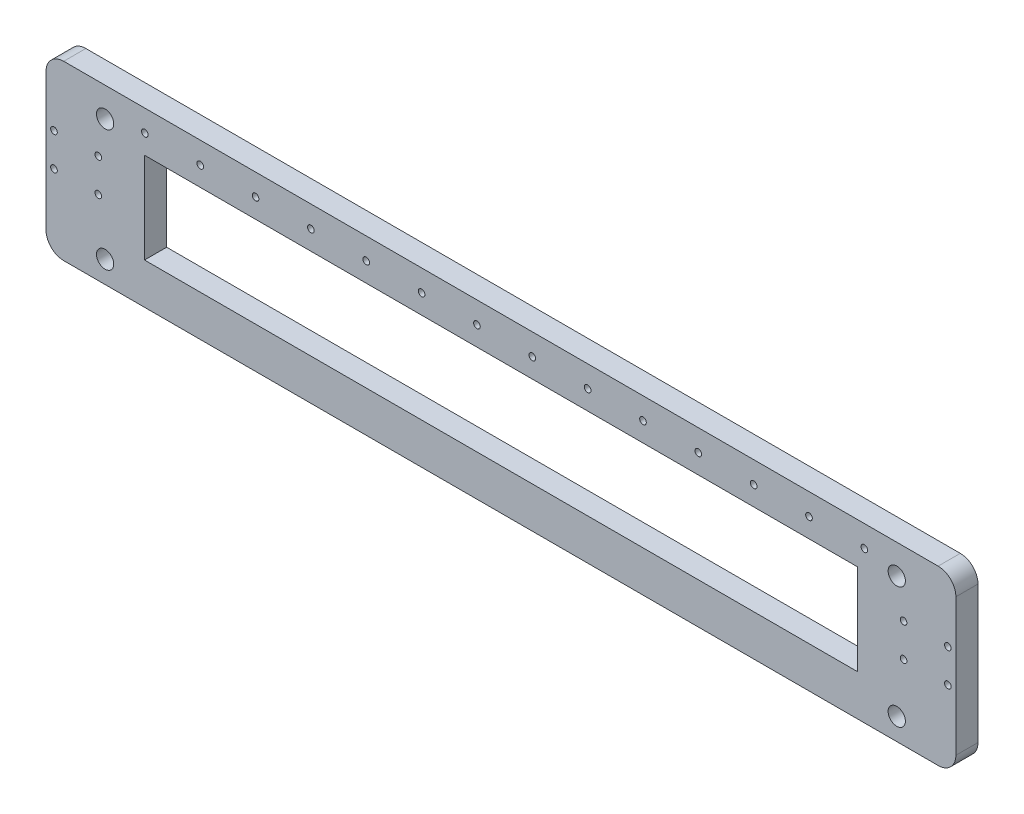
ISO-10303-21;
HEADER;
FILE_DESCRIPTION(('STEP AP214'),'2;1');
FILE_NAME('part.step','',(''),(''),'','','');
FILE_SCHEMA(('AUTOMOTIVE_DESIGN { 1 0 10303 214 1 1 1 1 }'));
ENDSEC;
DATA;
#1=APPLICATION_CONTEXT('core data for automotive mechanical design processes');
#2=APPLICATION_PROTOCOL_DEFINITION('international standard','automotive_design',2000,#1);
#3=PRODUCT_CONTEXT('',#1,'mechanical');
#4=PRODUCT('Part','Part','',(#3));
#5=PRODUCT_RELATED_PRODUCT_CATEGORY('part','',(#4));
#6=PRODUCT_DEFINITION_FORMATION('','',#4);
#7=PRODUCT_DEFINITION_CONTEXT('part definition',#1,'design');
#8=PRODUCT_DEFINITION('design','',#6,#7);
#9=PRODUCT_DEFINITION_SHAPE('','',#8);
#10=(LENGTH_UNIT() NAMED_UNIT(*) SI_UNIT(.MILLI.,.METRE.));
#11=(NAMED_UNIT(*) PLANE_ANGLE_UNIT() SI_UNIT($,.RADIAN.));
#12=(NAMED_UNIT(*) SI_UNIT($,.STERADIAN.) SOLID_ANGLE_UNIT());
#13=UNCERTAINTY_MEASURE_WITH_UNIT(LENGTH_MEASURE(1.E-05),#10,'distance_accuracy_value','');
#14=(GEOMETRIC_REPRESENTATION_CONTEXT(3) GLOBAL_UNCERTAINTY_ASSIGNED_CONTEXT((#13)) GLOBAL_UNIT_ASSIGNED_CONTEXT((#10,
#11,#12)) REPRESENTATION_CONTEXT('',''));
#15=CARTESIAN_POINT('',(0.,0.,0.));
#16=DIRECTION('',(0.,0.,1.));
#17=DIRECTION('',(1.,0.,0.));
#18=AXIS2_PLACEMENT_3D('',#15,#16,#17);
#19=CARTESIAN_POINT('',(197.5,-31.,10.));
#20=DIRECTION('',(0.,0.,1.));
#21=DIRECTION('',(1.,0.,0.));
#22=AXIS2_PLACEMENT_3D('',#19,#20,#21);
#23=PLANE('',#22);
#24=CARTESIAN_POINT('',(-160.835375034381,29.2352985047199,10.));
#25=DIRECTION('',(0.,0.,1.));
#26=DIRECTION('',(1.,0.,0.));
#27=AXIS2_PLACEMENT_3D('',#24,#25,#26);
#28=CIRCLE('',#27,1.5);
#29=CARTESIAN_POINT('',(-159.335375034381,29.2352985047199,10.));
#30=VERTEX_POINT('',#29);
#31=EDGE_CURVE('E310',#30,#30,#28,.T.);
#32=ORIENTED_EDGE('',*,*,#31,.F.);
#33=EDGE_LOOP('',(#32));
#34=FACE_BOUND('',#33,.T.);
#35=CARTESIAN_POINT('',(-135.835375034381,29.2352985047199,10.));
#36=DIRECTION('',(0.,0.,1.));
#37=DIRECTION('',(1.,0.,0.));
#38=AXIS2_PLACEMENT_3D('',#35,#36,#37);
#39=CIRCLE('',#38,1.5);
#40=CARTESIAN_POINT('',(-134.335375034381,29.2352985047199,10.));
#41=VERTEX_POINT('',#40);
#42=EDGE_CURVE('E751',#41,#41,#39,.T.);
#43=ORIENTED_EDGE('',*,*,#42,.F.);
#44=EDGE_LOOP('',(#43));
#45=FACE_BOUND('',#44,.T.);
#46=CARTESIAN_POINT('',(-110.835375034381,29.2352985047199,10.));
#47=DIRECTION('',(0.,0.,1.));
#48=DIRECTION('',(1.,0.,0.));
#49=AXIS2_PLACEMENT_3D('',#46,#47,#48);
#50=CIRCLE('',#49,1.5);
#51=CARTESIAN_POINT('',(-109.335375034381,29.2352985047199,10.));
#52=VERTEX_POINT('',#51);
#53=EDGE_CURVE('E755',#52,#52,#50,.T.);
#54=ORIENTED_EDGE('',*,*,#53,.F.);
#55=EDGE_LOOP('',(#54));
#56=FACE_BOUND('',#55,.T.);
#57=CARTESIAN_POINT('',(-85.8353750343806,29.2352985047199,10.));
#58=DIRECTION('',(0.,0.,1.));
#59=DIRECTION('',(1.,0.,0.));
#60=AXIS2_PLACEMENT_3D('',#57,#58,#59);
#61=CIRCLE('',#60,1.5);
#62=CARTESIAN_POINT('',(-84.3353750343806,29.2352985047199,10.));
#63=VERTEX_POINT('',#62);
#64=EDGE_CURVE('E761',#63,#63,#61,.T.);
#65=ORIENTED_EDGE('',*,*,#64,.F.);
#66=EDGE_LOOP('',(#65));
#67=FACE_BOUND('',#66,.T.);
#68=CARTESIAN_POINT('',(-60.8353750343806,29.2352985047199,10.));
#69=DIRECTION('',(0.,0.,1.));
#70=DIRECTION('',(1.,0.,0.));
#71=AXIS2_PLACEMENT_3D('',#68,#69,#70);
#72=CIRCLE('',#71,1.5);
#73=CARTESIAN_POINT('',(-59.3353750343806,29.2352985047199,10.));
#74=VERTEX_POINT('',#73);
#75=EDGE_CURVE('E765',#74,#74,#72,.T.);
#76=ORIENTED_EDGE('',*,*,#75,.F.);
#77=EDGE_LOOP('',(#76));
#78=FACE_BOUND('',#77,.T.);
#79=CARTESIAN_POINT('',(-35.8353750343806,29.2352985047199,10.));
#80=DIRECTION('',(0.,0.,1.));
#81=DIRECTION('',(1.,0.,0.));
#82=AXIS2_PLACEMENT_3D('',#79,#80,#81);
#83=CIRCLE('',#82,1.5);
#84=CARTESIAN_POINT('',(-34.3353750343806,29.2352985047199,10.));
#85=VERTEX_POINT('',#84);
#86=EDGE_CURVE('E769',#85,#85,#83,.T.);
#87=ORIENTED_EDGE('',*,*,#86,.F.);
#88=EDGE_LOOP('',(#87));
#89=FACE_BOUND('',#88,.T.);
#90=CARTESIAN_POINT('',(-10.8353750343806,29.2352985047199,10.));
#91=DIRECTION('',(0.,0.,1.));
#92=DIRECTION('',(1.,0.,0.));
#93=AXIS2_PLACEMENT_3D('',#90,#91,#92);
#94=CIRCLE('',#93,1.5);
#95=CARTESIAN_POINT('',(-9.33537503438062,29.2352985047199,10.));
#96=VERTEX_POINT('',#95);
#97=EDGE_CURVE('E773',#96,#96,#94,.T.);
#98=ORIENTED_EDGE('',*,*,#97,.F.);
#99=EDGE_LOOP('',(#98));
#100=FACE_BOUND('',#99,.T.);
#101=CARTESIAN_POINT('',(14.1646249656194,29.2352985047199,10.));
#102=DIRECTION('',(0.,0.,1.));
#103=DIRECTION('',(1.,0.,0.));
#104=AXIS2_PLACEMENT_3D('',#101,#102,#103);
#105=CIRCLE('',#104,1.5);
#106=CARTESIAN_POINT('',(15.6646249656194,29.2352985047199,10.));
#107=VERTEX_POINT('',#106);
#108=EDGE_CURVE('E777',#107,#107,#105,.T.);
#109=ORIENTED_EDGE('',*,*,#108,.F.);
#110=EDGE_LOOP('',(#109));
#111=FACE_BOUND('',#110,.T.);
#112=CARTESIAN_POINT('',(39.1646249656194,29.2352985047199,10.));
#113=DIRECTION('',(0.,0.,1.));
#114=DIRECTION('',(1.,0.,0.));
#115=AXIS2_PLACEMENT_3D('',#112,#113,#114);
#116=CIRCLE('',#115,1.5);
#117=CARTESIAN_POINT('',(40.6646249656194,29.2352985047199,10.));
#118=VERTEX_POINT('',#117);
#119=EDGE_CURVE('E781',#118,#118,#116,.T.);
#120=ORIENTED_EDGE('',*,*,#119,.F.);
#121=EDGE_LOOP('',(#120));
#122=FACE_BOUND('',#121,.T.);
#123=CARTESIAN_POINT('',(64.1646249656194,29.2352985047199,10.));
#124=DIRECTION('',(0.,0.,1.));
#125=DIRECTION('',(1.,0.,0.));
#126=AXIS2_PLACEMENT_3D('',#123,#124,#125);
#127=CIRCLE('',#126,1.5);
#128=CARTESIAN_POINT('',(65.6646249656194,29.2352985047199,10.));
#129=VERTEX_POINT('',#128);
#130=EDGE_CURVE('E785',#129,#129,#127,.T.);
#131=ORIENTED_EDGE('',*,*,#130,.F.);
#132=EDGE_LOOP('',(#131));
#133=FACE_BOUND('',#132,.T.);
#134=CARTESIAN_POINT('',(89.1646249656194,29.2352985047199,10.));
#135=DIRECTION('',(0.,0.,1.));
#136=DIRECTION('',(1.,0.,0.));
#137=AXIS2_PLACEMENT_3D('',#134,#135,#136);
#138=CIRCLE('',#137,1.5);
#139=CARTESIAN_POINT('',(90.6646249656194,29.2352985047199,10.));
#140=VERTEX_POINT('',#139);
#141=EDGE_CURVE('E789',#140,#140,#138,.T.);
#142=ORIENTED_EDGE('',*,*,#141,.F.);
#143=EDGE_LOOP('',(#142));
#144=FACE_BOUND('',#143,.T.);
#145=CARTESIAN_POINT('',(114.164624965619,29.2352985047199,10.));
#146=DIRECTION('',(0.,0.,1.));
#147=DIRECTION('',(1.,0.,0.));
#148=AXIS2_PLACEMENT_3D('',#145,#146,#147);
#149=CIRCLE('',#148,1.5);
#150=CARTESIAN_POINT('',(115.664624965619,29.2352985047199,10.));
#151=VERTEX_POINT('',#150);
#152=EDGE_CURVE('E793',#151,#151,#149,.T.);
#153=ORIENTED_EDGE('',*,*,#152,.F.);
#154=EDGE_LOOP('',(#153));
#155=FACE_BOUND('',#154,.T.);
#156=CARTESIAN_POINT('',(139.164624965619,29.2352985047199,10.));
#157=DIRECTION('',(0.,0.,1.));
#158=DIRECTION('',(1.,0.,0.));
#159=AXIS2_PLACEMENT_3D('',#156,#157,#158);
#160=CIRCLE('',#159,1.5);
#161=CARTESIAN_POINT('',(140.664624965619,29.2352985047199,10.));
#162=VERTEX_POINT('',#161);
#163=EDGE_CURVE('E797',#162,#162,#160,.T.);
#164=ORIENTED_EDGE('',*,*,#163,.F.);
#165=EDGE_LOOP('',(#164));
#166=FACE_BOUND('',#165,.T.);
#167=CARTESIAN_POINT('',(164.164624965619,29.2352985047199,10.));
#168=DIRECTION('',(0.,0.,1.));
#169=DIRECTION('',(1.,0.,0.));
#170=AXIS2_PLACEMENT_3D('',#167,#168,#169);
#171=CIRCLE('',#170,1.5);
#172=CARTESIAN_POINT('',(165.664624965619,29.2352985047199,10.));
#173=VERTEX_POINT('',#172);
#174=EDGE_CURVE('E801',#173,#173,#171,.T.);
#175=ORIENTED_EDGE('',*,*,#174,.F.);
#176=EDGE_LOOP('',(#175));
#177=FACE_BOUND('',#176,.T.);
#178=CARTESIAN_POINT('',(-181.88,-5.29999999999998,10.));
#179=DIRECTION('',(0.,0.,1.));
#180=DIRECTION('',(-1.,0.,0.));
#181=AXIS2_PLACEMENT_3D('',#178,#179,#180);
#182=CIRCLE('',#181,1.5);
#183=CARTESIAN_POINT('',(-183.38,-5.29999999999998,10.));
#184=VERTEX_POINT('',#183);
#185=EDGE_CURVE('E388',#184,#184,#182,.T.);
#186=ORIENTED_EDGE('',*,*,#185,.F.);
#187=EDGE_LOOP('',(#186));
#188=FACE_BOUND('',#187,.T.);
#189=CARTESIAN_POINT('',(-201.9,-5.29999999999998,10.));
#190=DIRECTION('',(0.,0.,1.));
#191=DIRECTION('',(-1.,0.,0.));
#192=AXIS2_PLACEMENT_3D('',#189,#190,#191);
#193=CIRCLE('',#192,1.5);
#194=CARTESIAN_POINT('',(-203.4,-5.29999999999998,10.));
#195=VERTEX_POINT('',#194);
#196=EDGE_CURVE('E384',#195,#195,#193,.T.);
#197=ORIENTED_EDGE('',*,*,#196,.F.);
#198=EDGE_LOOP('',(#197));
#199=FACE_BOUND('',#198,.T.);
#200=CARTESIAN_POINT('',(-178.8,-29.1,10.));
#201=DIRECTION('',(0.,0.,1.));
#202=DIRECTION('',(-1.,0.,0.));
#203=AXIS2_PLACEMENT_3D('',#200,#201,#202);
#204=CIRCLE('',#203,3.9);
#205=CARTESIAN_POINT('',(-182.7,-29.1,10.));
#206=VERTEX_POINT('',#205);
#207=EDGE_CURVE('E380',#206,#206,#204,.T.);
#208=ORIENTED_EDGE('',*,*,#207,.F.);
#209=EDGE_LOOP('',(#208));
#210=FACE_BOUND('',#209,.T.);
#211=CARTESIAN_POINT('',(178.8,-29.1,10.));
#212=DIRECTION('',(0.,0.,1.));
#213=DIRECTION('',(1.,0.,0.));
#214=AXIS2_PLACEMENT_3D('',#211,#212,#213);
#215=CIRCLE('',#214,3.9);
#216=CARTESIAN_POINT('',(182.7,-29.1,10.));
#217=VERTEX_POINT('',#216);
#218=EDGE_CURVE('E375',#217,#217,#215,.T.);
#219=ORIENTED_EDGE('',*,*,#218,.F.);
#220=EDGE_LOOP('',(#219));
#221=FACE_BOUND('',#220,.T.);
#222=CARTESIAN_POINT('',(201.9,-5.29999999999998,10.));
#223=DIRECTION('',(0.,0.,1.));
#224=DIRECTION('',(1.,0.,0.));
#225=AXIS2_PLACEMENT_3D('',#222,#223,#224);
#226=CIRCLE('',#225,1.5);
#227=CARTESIAN_POINT('',(203.4,-5.29999999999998,10.));
#228=VERTEX_POINT('',#227);
#229=EDGE_CURVE('E379',#228,#228,#226,.T.);
#230=ORIENTED_EDGE('',*,*,#229,.F.);
#231=EDGE_LOOP('',(#230));
#232=FACE_BOUND('',#231,.T.);
#233=CARTESIAN_POINT('',(181.88,-5.29999999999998,10.));
#234=DIRECTION('',(0.,0.,1.));
#235=DIRECTION('',(1.,0.,0.));
#236=AXIS2_PLACEMENT_3D('',#233,#234,#235);
#237=CIRCLE('',#236,1.5);
#238=CARTESIAN_POINT('',(183.38,-5.29999999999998,10.));
#239=VERTEX_POINT('',#238);
#240=EDGE_CURVE('E400',#239,#239,#237,.T.);
#241=ORIENTED_EDGE('',*,*,#240,.F.);
#242=EDGE_LOOP('',(#241));
#243=FACE_BOUND('',#242,.T.);
#244=CARTESIAN_POINT('',(201.9,9.70000000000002,10.));
#245=DIRECTION('',(0.,0.,1.));
#246=DIRECTION('',(1.,0.,0.));
#247=AXIS2_PLACEMENT_3D('',#244,#245,#246);
#248=CIRCLE('',#247,1.5);
#249=CARTESIAN_POINT('',(203.4,9.70000000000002,10.));
#250=VERTEX_POINT('',#249);
#251=EDGE_CURVE('E396',#250,#250,#248,.T.);
#252=ORIENTED_EDGE('',*,*,#251,.F.);
#253=EDGE_LOOP('',(#252));
#254=FACE_BOUND('',#253,.T.);
#255=CARTESIAN_POINT('',(181.88,9.70000000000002,10.));
#256=DIRECTION('',(0.,0.,1.));
#257=DIRECTION('',(1.,0.,0.));
#258=AXIS2_PLACEMENT_3D('',#255,#256,#257);
#259=CIRCLE('',#258,1.5);
#260=CARTESIAN_POINT('',(183.38,9.70000000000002,10.));
#261=VERTEX_POINT('',#260);
#262=EDGE_CURVE('E392',#261,#261,#259,.T.);
#263=ORIENTED_EDGE('',*,*,#262,.F.);
#264=EDGE_LOOP('',(#263));
#265=FACE_BOUND('',#264,.T.);
#266=CARTESIAN_POINT('',(-201.9,9.70000000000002,10.));
#267=DIRECTION('',(0.,0.,1.));
#268=DIRECTION('',(-1.,0.,0.));
#269=AXIS2_PLACEMENT_3D('',#266,#267,#268);
#270=CIRCLE('',#269,1.5);
#271=CARTESIAN_POINT('',(-203.4,9.70000000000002,10.));
#272=VERTEX_POINT('',#271);
#273=EDGE_CURVE('E371',#272,#272,#270,.T.);
#274=ORIENTED_EDGE('',*,*,#273,.F.);
#275=EDGE_LOOP('',(#274));
#276=FACE_BOUND('',#275,.T.);
#277=CARTESIAN_POINT('',(-181.88,9.70000000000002,10.));
#278=DIRECTION('',(0.,0.,1.));
#279=DIRECTION('',(-1.,0.,0.));
#280=AXIS2_PLACEMENT_3D('',#277,#278,#279);
#281=CIRCLE('',#280,1.5);
#282=CARTESIAN_POINT('',(-183.38,9.70000000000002,10.));
#283=VERTEX_POINT('',#282);
#284=EDGE_CURVE('E365',#283,#283,#281,.T.);
#285=ORIENTED_EDGE('',*,*,#284,.F.);
#286=EDGE_LOOP('',(#285));
#287=FACE_BOUND('',#286,.T.);
#288=CARTESIAN_POINT('',(-178.8,25.8,10.));
#289=DIRECTION('',(0.,0.,1.));
#290=DIRECTION('',(-1.,0.,0.));
#291=AXIS2_PLACEMENT_3D('',#288,#289,#290);
#292=CIRCLE('',#291,3.9);
#293=CARTESIAN_POINT('',(-182.7,25.8,10.));
#294=VERTEX_POINT('',#293);
#295=EDGE_CURVE('E360',#294,#294,#292,.T.);
#296=ORIENTED_EDGE('',*,*,#295,.F.);
#297=EDGE_LOOP('',(#296));
#298=FACE_BOUND('',#297,.T.);
#299=CARTESIAN_POINT('',(178.8,25.8,10.));
#300=DIRECTION('',(0.,0.,1.));
#301=DIRECTION('',(1.,0.,0.));
#302=AXIS2_PLACEMENT_3D('',#299,#300,#301);
#303=CIRCLE('',#302,3.9);
#304=CARTESIAN_POINT('',(182.7,25.8,10.));
#305=VERTEX_POINT('',#304);
#306=EDGE_CURVE('E262',#305,#305,#303,.T.);
#307=ORIENTED_EDGE('',*,*,#306,.F.);
#308=EDGE_LOOP('',(#307));
#309=FACE_BOUND('',#308,.T.);
#310=CARTESIAN_POINT('',(197.5,-31.,10.));
#311=DIRECTION('',(0.,0.,1.));
#312=DIRECTION('',(1.,0.,0.));
#313=AXIS2_PLACEMENT_3D('',#310,#311,#312);
#314=CIRCLE('',#313,8.);
#315=CARTESIAN_POINT('',(197.5,-39.,10.));
#316=VERTEX_POINT('',#315);
#317=CARTESIAN_POINT('',(205.5,-30.9999999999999,10.));
#318=VERTEX_POINT('',#317);
#319=EDGE_CURVE('E181',#316,#318,#314,.T.);
#320=ORIENTED_EDGE('',*,*,#319,.T.);
#321=DIRECTION('',(0.,1.,0.));
#322=VECTOR('',#321,1.);
#323=CARTESIAN_POINT('',(205.5,31.,10.));
#324=LINE('',#323,#322);
#325=CARTESIAN_POINT('',(205.5,31.,10.));
#326=VERTEX_POINT('',#325);
#327=EDGE_CURVE('E185',#318,#326,#324,.T.);
#328=ORIENTED_EDGE('',*,*,#327,.T.);
#329=CARTESIAN_POINT('',(197.5,31.,10.));
#330=DIRECTION('',(0.,0.,1.));
#331=DIRECTION('',(1.,0.,0.));
#332=AXIS2_PLACEMENT_3D('',#329,#330,#331);
#333=CIRCLE('',#332,8.);
#334=CARTESIAN_POINT('',(197.5,39.,10.));
#335=VERTEX_POINT('',#334);
#336=EDGE_CURVE('E189',#326,#335,#333,.T.);
#337=ORIENTED_EDGE('',*,*,#336,.T.);
#338=DIRECTION('',(-1.,0.,0.));
#339=VECTOR('',#338,1.);
#340=CARTESIAN_POINT('',(-197.5,39.,10.));
#341=LINE('',#340,#339);
#342=CARTESIAN_POINT('',(-197.5,39.,10.));
#343=VERTEX_POINT('',#342);
#344=EDGE_CURVE('E192',#335,#343,#341,.T.);
#345=ORIENTED_EDGE('',*,*,#344,.T.);
#346=CARTESIAN_POINT('',(-197.5,31.,10.));
#347=DIRECTION('',(0.,0.,1.));
#348=DIRECTION('',(-1.,0.,0.));
#349=AXIS2_PLACEMENT_3D('',#346,#347,#348);
#350=CIRCLE('',#349,8.);
#351=CARTESIAN_POINT('',(-205.5,31.,10.));
#352=VERTEX_POINT('',#351);
#353=EDGE_CURVE('E195',#343,#352,#350,.T.);
#354=ORIENTED_EDGE('',*,*,#353,.T.);
#355=DIRECTION('',(0.,-1.,0.));
#356=VECTOR('',#355,1.);
#357=CARTESIAN_POINT('',(-205.5,31.,10.));
#358=LINE('',#357,#356);
#359=CARTESIAN_POINT('',(-205.5,-31.,10.));
#360=VERTEX_POINT('',#359);
#361=EDGE_CURVE('E198',#352,#360,#358,.T.);
#362=ORIENTED_EDGE('',*,*,#361,.T.);
#363=CARTESIAN_POINT('',(-197.5,-31.,10.));
#364=DIRECTION('',(0.,0.,1.));
#365=DIRECTION('',(-1.,0.,0.));
#366=AXIS2_PLACEMENT_3D('',#363,#364,#365);
#367=CIRCLE('',#366,8.);
#368=CARTESIAN_POINT('',(-197.5,-39.,10.));
#369=VERTEX_POINT('',#368);
#370=EDGE_CURVE('E201',#360,#369,#367,.T.);
#371=ORIENTED_EDGE('',*,*,#370,.T.);
#372=DIRECTION('',(1.,0.,0.));
#373=VECTOR('',#372,1.);
#374=CARTESIAN_POINT('',(-197.5,-39.,10.));
#375=LINE('',#374,#373);
#376=EDGE_CURVE('E204',#369,#316,#375,.T.);
#377=ORIENTED_EDGE('',*,*,#376,.T.);
#378=EDGE_LOOP('',(#320,#328,#337,#345,#354,#362,#371,#377));
#379=FACE_BOUND('',#378,.T.);
#380=DIRECTION('',(-1.,0.,0.));
#381=VECTOR('',#380,1.);
#382=CARTESIAN_POINT('',(-161.,20.5,10.));
#383=LINE('',#382,#381);
#384=CARTESIAN_POINT('',(161.,20.5,10.));
#385=VERTEX_POINT('',#384);
#386=CARTESIAN_POINT('',(-161.,20.5,10.));
#387=VERTEX_POINT('',#386);
#388=EDGE_CURVE('E140',#385,#387,#383,.T.);
#389=ORIENTED_EDGE('',*,*,#388,.F.);
#390=DIRECTION('',(0.,1.,0.));
#391=VECTOR('',#390,1.);
#392=CARTESIAN_POINT('',(161.,20.5,10.));
#393=LINE('',#392,#391);
#394=CARTESIAN_POINT('',(161.,-20.5,10.));
#395=VERTEX_POINT('',#394);
#396=EDGE_CURVE('E131',#395,#385,#393,.T.);
#397=ORIENTED_EDGE('',*,*,#396,.F.);
#398=DIRECTION('',(1.,0.,0.));
#399=VECTOR('',#398,1.);
#400=CARTESIAN_POINT('',(-161.,-20.5,10.));
#401=LINE('',#400,#399);
#402=CARTESIAN_POINT('',(-161.,-20.5,10.));
#403=VERTEX_POINT('',#402);
#404=EDGE_CURVE('E157',#403,#395,#401,.T.);
#405=ORIENTED_EDGE('',*,*,#404,.F.);
#406=DIRECTION('',(0.,-1.,0.));
#407=VECTOR('',#406,1.);
#408=CARTESIAN_POINT('',(-161.,20.5,10.));
#409=LINE('',#408,#407);
#410=EDGE_CURVE('E153',#387,#403,#409,.T.);
#411=ORIENTED_EDGE('',*,*,#410,.F.);
#412=EDGE_LOOP('',(#389,#397,#405,#411));
#413=FACE_BOUND('',#412,.T.);
#414=ADVANCED_FACE('F39',(#34,#45,#56,#67,#78,#89,#100,#111,#122,#133,#144,#155,#166,#177,#188,
#199,#210,#221,#232,#243,#254,#265,#276,#287,#298,#309,#379,#413),#23,.T.);
#415=CARTESIAN_POINT('',(197.5,-31.,0.));
#416=DIRECTION('',(0.,0.,1.));
#417=DIRECTION('',(1.,0.,0.));
#418=AXIS2_PLACEMENT_3D('',#415,#416,#417);
#419=PLANE('',#418);
#420=CARTESIAN_POINT('',(-160.835375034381,29.2352985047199,0.));
#421=DIRECTION('',(0.,0.,1.));
#422=DIRECTION('',(1.,0.,0.));
#423=AXIS2_PLACEMENT_3D('',#420,#421,#422);
#424=CIRCLE('',#423,1.5);
#425=CARTESIAN_POINT('',(-159.335375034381,29.2352985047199,0.));
#426=VERTEX_POINT('',#425);
#427=EDGE_CURVE('E43',#426,#426,#424,.T.);
#428=ORIENTED_EDGE('',*,*,#427,.T.);
#429=EDGE_LOOP('',(#428));
#430=FACE_BOUND('',#429,.T.);
#431=CARTESIAN_POINT('',(-135.835375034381,29.2352985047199,0.));
#432=DIRECTION('',(0.,0.,1.));
#433=DIRECTION('',(1.,0.,0.));
#434=AXIS2_PLACEMENT_3D('',#431,#432,#433);
#435=CIRCLE('',#434,1.5);
#436=CARTESIAN_POINT('',(-134.335375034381,29.2352985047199,0.));
#437=VERTEX_POINT('',#436);
#438=EDGE_CURVE('E353',#437,#437,#435,.T.);
#439=ORIENTED_EDGE('',*,*,#438,.T.);
#440=EDGE_LOOP('',(#439));
#441=FACE_BOUND('',#440,.T.);
#442=CARTESIAN_POINT('',(-110.835375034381,29.2352985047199,0.));
#443=DIRECTION('',(0.,0.,1.));
#444=DIRECTION('',(1.,0.,0.));
#445=AXIS2_PLACEMENT_3D('',#442,#443,#444);
#446=CIRCLE('',#445,1.5);
#447=CARTESIAN_POINT('',(-109.335375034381,29.2352985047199,0.));
#448=VERTEX_POINT('',#447);
#449=EDGE_CURVE('E350',#448,#448,#446,.T.);
#450=ORIENTED_EDGE('',*,*,#449,.T.);
#451=EDGE_LOOP('',(#450));
#452=FACE_BOUND('',#451,.T.);
#453=CARTESIAN_POINT('',(-85.8353750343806,29.2352985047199,0.));
#454=DIRECTION('',(0.,0.,1.));
#455=DIRECTION('',(1.,0.,0.));
#456=AXIS2_PLACEMENT_3D('',#453,#454,#455);
#457=CIRCLE('',#456,1.5);
#458=CARTESIAN_POINT('',(-84.3353750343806,29.2352985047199,0.));
#459=VERTEX_POINT('',#458);
#460=EDGE_CURVE('E346',#459,#459,#457,.T.);
#461=ORIENTED_EDGE('',*,*,#460,.T.);
#462=EDGE_LOOP('',(#461));
#463=FACE_BOUND('',#462,.T.);
#464=CARTESIAN_POINT('',(-60.8353750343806,29.2352985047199,0.));
#465=DIRECTION('',(0.,0.,1.));
#466=DIRECTION('',(1.,0.,0.));
#467=AXIS2_PLACEMENT_3D('',#464,#465,#466);
#468=CIRCLE('',#467,1.5);
#469=CARTESIAN_POINT('',(-59.3353750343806,29.2352985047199,0.));
#470=VERTEX_POINT('',#469);
#471=EDGE_CURVE('E342',#470,#470,#468,.T.);
#472=ORIENTED_EDGE('',*,*,#471,.T.);
#473=EDGE_LOOP('',(#472));
#474=FACE_BOUND('',#473,.T.);
#475=CARTESIAN_POINT('',(-35.8353750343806,29.2352985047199,0.));
#476=DIRECTION('',(0.,0.,1.));
#477=DIRECTION('',(1.,0.,0.));
#478=AXIS2_PLACEMENT_3D('',#475,#476,#477);
#479=CIRCLE('',#478,1.5);
#480=CARTESIAN_POINT('',(-34.3353750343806,29.2352985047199,0.));
#481=VERTEX_POINT('',#480);
#482=EDGE_CURVE('E338',#481,#481,#479,.T.);
#483=ORIENTED_EDGE('',*,*,#482,.T.);
#484=EDGE_LOOP('',(#483));
#485=FACE_BOUND('',#484,.T.);
#486=CARTESIAN_POINT('',(-10.8353750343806,29.2352985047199,0.));
#487=DIRECTION('',(0.,0.,1.));
#488=DIRECTION('',(1.,0.,0.));
#489=AXIS2_PLACEMENT_3D('',#486,#487,#488);
#490=CIRCLE('',#489,1.5);
#491=CARTESIAN_POINT('',(-9.33537503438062,29.2352985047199,0.));
#492=VERTEX_POINT('',#491);
#493=EDGE_CURVE('E334',#492,#492,#490,.T.);
#494=ORIENTED_EDGE('',*,*,#493,.T.);
#495=EDGE_LOOP('',(#494));
#496=FACE_BOUND('',#495,.T.);
#497=CARTESIAN_POINT('',(14.1646249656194,29.2352985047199,0.));
#498=DIRECTION('',(0.,0.,1.));
#499=DIRECTION('',(1.,0.,0.));
#500=AXIS2_PLACEMENT_3D('',#497,#498,#499);
#501=CIRCLE('',#500,1.5);
#502=CARTESIAN_POINT('',(15.6646249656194,29.2352985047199,0.));
#503=VERTEX_POINT('',#502);
#504=EDGE_CURVE('E330',#503,#503,#501,.T.);
#505=ORIENTED_EDGE('',*,*,#504,.T.);
#506=EDGE_LOOP('',(#505));
#507=FACE_BOUND('',#506,.T.);
#508=CARTESIAN_POINT('',(39.1646249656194,29.2352985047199,0.));
#509=DIRECTION('',(0.,0.,1.));
#510=DIRECTION('',(1.,0.,0.));
#511=AXIS2_PLACEMENT_3D('',#508,#509,#510);
#512=CIRCLE('',#511,1.5);
#513=CARTESIAN_POINT('',(40.6646249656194,29.2352985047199,0.));
#514=VERTEX_POINT('',#513);
#515=EDGE_CURVE('E326',#514,#514,#512,.T.);
#516=ORIENTED_EDGE('',*,*,#515,.T.);
#517=EDGE_LOOP('',(#516));
#518=FACE_BOUND('',#517,.T.);
#519=CARTESIAN_POINT('',(64.1646249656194,29.2352985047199,0.));
#520=DIRECTION('',(0.,0.,1.));
#521=DIRECTION('',(1.,0.,0.));
#522=AXIS2_PLACEMENT_3D('',#519,#520,#521);
#523=CIRCLE('',#522,1.5);
#524=CARTESIAN_POINT('',(65.6646249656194,29.2352985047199,0.));
#525=VERTEX_POINT('',#524);
#526=EDGE_CURVE('E322',#525,#525,#523,.T.);
#527=ORIENTED_EDGE('',*,*,#526,.T.);
#528=EDGE_LOOP('',(#527));
#529=FACE_BOUND('',#528,.T.);
#530=CARTESIAN_POINT('',(89.1646249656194,29.2352985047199,0.));
#531=DIRECTION('',(0.,0.,1.));
#532=DIRECTION('',(1.,0.,0.));
#533=AXIS2_PLACEMENT_3D('',#530,#531,#532);
#534=CIRCLE('',#533,1.5);
#535=CARTESIAN_POINT('',(90.6646249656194,29.2352985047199,0.));
#536=VERTEX_POINT('',#535);
#537=EDGE_CURVE('E318',#536,#536,#534,.T.);
#538=ORIENTED_EDGE('',*,*,#537,.T.);
#539=EDGE_LOOP('',(#538));
#540=FACE_BOUND('',#539,.T.);
#541=CARTESIAN_POINT('',(114.164624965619,29.2352985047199,0.));
#542=DIRECTION('',(0.,0.,1.));
#543=DIRECTION('',(1.,0.,0.));
#544=AXIS2_PLACEMENT_3D('',#541,#542,#543);
#545=CIRCLE('',#544,1.5);
#546=CARTESIAN_POINT('',(115.664624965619,29.2352985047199,0.));
#547=VERTEX_POINT('',#546);
#548=EDGE_CURVE('E314',#547,#547,#545,.T.);
#549=ORIENTED_EDGE('',*,*,#548,.T.);
#550=EDGE_LOOP('',(#549));
#551=FACE_BOUND('',#550,.T.);
#552=CARTESIAN_POINT('',(139.164624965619,29.2352985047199,0.));
#553=DIRECTION('',(0.,0.,1.));
#554=DIRECTION('',(1.,0.,0.));
#555=AXIS2_PLACEMENT_3D('',#552,#553,#554);
#556=CIRCLE('',#555,1.5);
#557=CARTESIAN_POINT('',(140.664624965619,29.2352985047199,0.));
#558=VERTEX_POINT('',#557);
#559=EDGE_CURVE('E309',#558,#558,#556,.T.);
#560=ORIENTED_EDGE('',*,*,#559,.T.);
#561=EDGE_LOOP('',(#560));
#562=FACE_BOUND('',#561,.T.);
#563=CARTESIAN_POINT('',(164.164624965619,29.2352985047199,0.));
#564=DIRECTION('',(0.,0.,1.));
#565=DIRECTION('',(1.,0.,0.));
#566=AXIS2_PLACEMENT_3D('',#563,#564,#565);
#567=CIRCLE('',#566,1.5);
#568=CARTESIAN_POINT('',(165.664624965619,29.2352985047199,0.));
#569=VERTEX_POINT('',#568);
#570=EDGE_CURVE('E305',#569,#569,#567,.T.);
#571=ORIENTED_EDGE('',*,*,#570,.T.);
#572=EDGE_LOOP('',(#571));
#573=FACE_BOUND('',#572,.T.);
#574=CARTESIAN_POINT('',(-181.88,-5.29999999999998,0.));
#575=DIRECTION('',(0.,0.,1.));
#576=DIRECTION('',(1.,0.,0.));
#577=AXIS2_PLACEMENT_3D('',#574,#575,#576);
#578=CIRCLE('',#577,1.5);
#579=CARTESIAN_POINT('',(-180.38,-5.29999999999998,0.));
#580=VERTEX_POINT('',#579);
#581=EDGE_CURVE('E165',#580,#580,#578,.T.);
#582=ORIENTED_EDGE('',*,*,#581,.T.);
#583=EDGE_LOOP('',(#582));
#584=FACE_BOUND('',#583,.T.);
#585=CARTESIAN_POINT('',(-201.9,-5.29999999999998,0.));
#586=DIRECTION('',(0.,0.,1.));
#587=DIRECTION('',(1.,0.,0.));
#588=AXIS2_PLACEMENT_3D('',#585,#586,#587);
#589=CIRCLE('',#588,1.5);
#590=CARTESIAN_POINT('',(-200.4,-5.29999999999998,0.));
#591=VERTEX_POINT('',#590);
#592=EDGE_CURVE('E298',#591,#591,#589,.T.);
#593=ORIENTED_EDGE('',*,*,#592,.T.);
#594=EDGE_LOOP('',(#593));
#595=FACE_BOUND('',#594,.T.);
#596=CARTESIAN_POINT('',(-178.8,-29.1,0.));
#597=DIRECTION('',(0.,0.,1.));
#598=DIRECTION('',(1.,0.,0.));
#599=AXIS2_PLACEMENT_3D('',#596,#597,#598);
#600=CIRCLE('',#599,3.9);
#601=CARTESIAN_POINT('',(-174.9,-29.1,0.));
#602=VERTEX_POINT('',#601);
#603=EDGE_CURVE('E294',#602,#602,#600,.T.);
#604=ORIENTED_EDGE('',*,*,#603,.T.);
#605=EDGE_LOOP('',(#604));
#606=FACE_BOUND('',#605,.T.);
#607=CARTESIAN_POINT('',(178.8,-29.1,0.));
#608=DIRECTION('',(0.,0.,1.));
#609=DIRECTION('',(1.,0.,0.));
#610=AXIS2_PLACEMENT_3D('',#607,#608,#609);
#611=CIRCLE('',#610,3.9);
#612=CARTESIAN_POINT('',(182.7,-29.1,0.));
#613=VERTEX_POINT('',#612);
#614=EDGE_CURVE('E290',#613,#613,#611,.T.);
#615=ORIENTED_EDGE('',*,*,#614,.T.);
#616=EDGE_LOOP('',(#615));
#617=FACE_BOUND('',#616,.T.);
#618=CARTESIAN_POINT('',(201.9,-5.29999999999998,0.));
#619=DIRECTION('',(0.,0.,1.));
#620=DIRECTION('',(1.,0.,0.));
#621=AXIS2_PLACEMENT_3D('',#618,#619,#620);
#622=CIRCLE('',#621,1.5);
#623=CARTESIAN_POINT('',(203.4,-5.29999999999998,0.));
#624=VERTEX_POINT('',#623);
#625=EDGE_CURVE('E286',#624,#624,#622,.T.);
#626=ORIENTED_EDGE('',*,*,#625,.T.);
#627=EDGE_LOOP('',(#626));
#628=FACE_BOUND('',#627,.T.);
#629=CARTESIAN_POINT('',(181.88,-5.29999999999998,0.));
#630=DIRECTION('',(0.,0.,1.));
#631=DIRECTION('',(1.,0.,0.));
#632=AXIS2_PLACEMENT_3D('',#629,#630,#631);
#633=CIRCLE('',#632,1.5);
#634=CARTESIAN_POINT('',(183.38,-5.29999999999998,0.));
#635=VERTEX_POINT('',#634);
#636=EDGE_CURVE('E282',#635,#635,#633,.T.);
#637=ORIENTED_EDGE('',*,*,#636,.T.);
#638=EDGE_LOOP('',(#637));
#639=FACE_BOUND('',#638,.T.);
#640=CARTESIAN_POINT('',(201.9,9.70000000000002,0.));
#641=DIRECTION('',(0.,0.,1.));
#642=DIRECTION('',(1.,0.,0.));
#643=AXIS2_PLACEMENT_3D('',#640,#641,#642);
#644=CIRCLE('',#643,1.5);
#645=CARTESIAN_POINT('',(203.4,9.70000000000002,0.));
#646=VERTEX_POINT('',#645);
#647=EDGE_CURVE('E278',#646,#646,#644,.T.);
#648=ORIENTED_EDGE('',*,*,#647,.T.);
#649=EDGE_LOOP('',(#648));
#650=FACE_BOUND('',#649,.T.);
#651=CARTESIAN_POINT('',(181.88,9.70000000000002,0.));
#652=DIRECTION('',(0.,0.,1.));
#653=DIRECTION('',(1.,0.,0.));
#654=AXIS2_PLACEMENT_3D('',#651,#652,#653);
#655=CIRCLE('',#654,1.5);
#656=CARTESIAN_POINT('',(183.38,9.70000000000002,0.));
#657=VERTEX_POINT('',#656);
#658=EDGE_CURVE('E274',#657,#657,#655,.T.);
#659=ORIENTED_EDGE('',*,*,#658,.T.);
#660=EDGE_LOOP('',(#659));
#661=FACE_BOUND('',#660,.T.);
#662=CARTESIAN_POINT('',(-201.9,9.70000000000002,0.));
#663=DIRECTION('',(0.,0.,1.));
#664=DIRECTION('',(1.,0.,0.));
#665=AXIS2_PLACEMENT_3D('',#662,#663,#664);
#666=CIRCLE('',#665,1.5);
#667=CARTESIAN_POINT('',(-200.4,9.70000000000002,0.));
#668=VERTEX_POINT('',#667);
#669=EDGE_CURVE('E270',#668,#668,#666,.T.);
#670=ORIENTED_EDGE('',*,*,#669,.T.);
#671=EDGE_LOOP('',(#670));
#672=FACE_BOUND('',#671,.T.);
#673=CARTESIAN_POINT('',(-181.88,9.70000000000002,0.));
#674=DIRECTION('',(0.,0.,1.));
#675=DIRECTION('',(1.,0.,0.));
#676=AXIS2_PLACEMENT_3D('',#673,#674,#675);
#677=CIRCLE('',#676,1.5);
#678=CARTESIAN_POINT('',(-180.38,9.70000000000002,0.));
#679=VERTEX_POINT('',#678);
#680=EDGE_CURVE('E266',#679,#679,#677,.T.);
#681=ORIENTED_EDGE('',*,*,#680,.T.);
#682=EDGE_LOOP('',(#681));
#683=FACE_BOUND('',#682,.T.);
#684=CARTESIAN_POINT('',(-178.8,25.8,0.));
#685=DIRECTION('',(0.,0.,1.));
#686=DIRECTION('',(1.,0.,0.));
#687=AXIS2_PLACEMENT_3D('',#684,#685,#686);
#688=CIRCLE('',#687,3.9);
#689=CARTESIAN_POINT('',(-174.9,25.8,0.));
#690=VERTEX_POINT('',#689);
#691=EDGE_CURVE('E261',#690,#690,#688,.T.);
#692=ORIENTED_EDGE('',*,*,#691,.T.);
#693=EDGE_LOOP('',(#692));
#694=FACE_BOUND('',#693,.T.);
#695=CARTESIAN_POINT('',(178.8,25.8,0.));
#696=DIRECTION('',(0.,0.,1.));
#697=DIRECTION('',(1.,0.,0.));
#698=AXIS2_PLACEMENT_3D('',#695,#696,#697);
#699=CIRCLE('',#698,3.9);
#700=CARTESIAN_POINT('',(182.7,25.8,0.));
#701=VERTEX_POINT('',#700);
#702=EDGE_CURVE('E257',#701,#701,#699,.T.);
#703=ORIENTED_EDGE('',*,*,#702,.T.);
#704=EDGE_LOOP('',(#703));
#705=FACE_BOUND('',#704,.T.);
#706=CARTESIAN_POINT('',(197.5,-31.,0.));
#707=DIRECTION('',(0.,0.,1.));
#708=DIRECTION('',(1.,0.,0.));
#709=AXIS2_PLACEMENT_3D('',#706,#707,#708);
#710=CIRCLE('',#709,8.);
#711=CARTESIAN_POINT('',(197.5,-39.,0.));
#712=VERTEX_POINT('',#711);
#713=CARTESIAN_POINT('',(205.5,-30.9999999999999,0.));
#714=VERTEX_POINT('',#713);
#715=EDGE_CURVE('E149',#712,#714,#710,.T.);
#716=ORIENTED_EDGE('',*,*,#715,.F.);
#717=DIRECTION('',(1.,0.,0.));
#718=VECTOR('',#717,1.);
#719=CARTESIAN_POINT('',(-197.5,-39.,0.));
#720=LINE('',#719,#718);
#721=CARTESIAN_POINT('',(-197.5,-39.,0.));
#722=VERTEX_POINT('',#721);
#723=EDGE_CURVE('E186',#722,#712,#720,.T.);
#724=ORIENTED_EDGE('',*,*,#723,.F.);
#725=CARTESIAN_POINT('',(-197.5,-31.,0.));
#726=DIRECTION('',(0.,0.,1.));
#727=DIRECTION('',(-1.,0.,0.));
#728=AXIS2_PLACEMENT_3D('',#725,#726,#727);
#729=CIRCLE('',#728,8.);
#730=CARTESIAN_POINT('',(-205.5,-31.,0.));
#731=VERTEX_POINT('',#730);
#732=EDGE_CURVE('E226',#731,#722,#729,.T.);
#733=ORIENTED_EDGE('',*,*,#732,.F.);
#734=DIRECTION('',(0.,-1.,0.));
#735=VECTOR('',#734,1.);
#736=CARTESIAN_POINT('',(-205.5,31.,0.));
#737=LINE('',#736,#735);
#738=CARTESIAN_POINT('',(-205.5,31.,0.));
#739=VERTEX_POINT('',#738);
#740=EDGE_CURVE('E223',#739,#731,#737,.T.);
#741=ORIENTED_EDGE('',*,*,#740,.F.);
#742=CARTESIAN_POINT('',(-197.5,31.,0.));
#743=DIRECTION('',(0.,0.,1.));
#744=DIRECTION('',(-1.,0.,0.));
#745=AXIS2_PLACEMENT_3D('',#742,#743,#744);
#746=CIRCLE('',#745,8.);
#747=CARTESIAN_POINT('',(-197.5,39.,0.));
#748=VERTEX_POINT('',#747);
#749=EDGE_CURVE('E220',#748,#739,#746,.T.);
#750=ORIENTED_EDGE('',*,*,#749,.F.);
#751=DIRECTION('',(-1.,0.,0.));
#752=VECTOR('',#751,1.);
#753=CARTESIAN_POINT('',(-197.5,39.,0.));
#754=LINE('',#753,#752);
#755=CARTESIAN_POINT('',(197.5,39.,0.));
#756=VERTEX_POINT('',#755);
#757=EDGE_CURVE('E217',#756,#748,#754,.T.);
#758=ORIENTED_EDGE('',*,*,#757,.F.);
#759=CARTESIAN_POINT('',(197.5,31.,0.));
#760=DIRECTION('',(0.,0.,1.));
#761=DIRECTION('',(1.,0.,0.));
#762=AXIS2_PLACEMENT_3D('',#759,#760,#761);
#763=CIRCLE('',#762,8.);
#764=CARTESIAN_POINT('',(205.5,31.,0.));
#765=VERTEX_POINT('',#764);
#766=EDGE_CURVE('E214',#765,#756,#763,.T.);
#767=ORIENTED_EDGE('',*,*,#766,.F.);
#768=DIRECTION('',(0.,1.,0.));
#769=VECTOR('',#768,1.);
#770=CARTESIAN_POINT('',(205.5,31.,0.));
#771=LINE('',#770,#769);
#772=EDGE_CURVE('E211',#714,#765,#771,.T.);
#773=ORIENTED_EDGE('',*,*,#772,.F.);
#774=EDGE_LOOP('',(#716,#724,#733,#741,#750,#758,#767,#773));
#775=FACE_BOUND('',#774,.T.);
#776=DIRECTION('',(0.,1.,0.));
#777=VECTOR('',#776,1.);
#778=CARTESIAN_POINT('',(161.,20.5,0.));
#779=LINE('',#778,#777);
#780=CARTESIAN_POINT('',(161.,-20.5,0.));
#781=VERTEX_POINT('',#780);
#782=CARTESIAN_POINT('',(161.,20.5,0.));
#783=VERTEX_POINT('',#782);
#784=EDGE_CURVE('E65',#781,#783,#779,.T.);
#785=ORIENTED_EDGE('',*,*,#784,.T.);
#786=DIRECTION('',(-1.,0.,0.));
#787=VECTOR('',#786,1.);
#788=CARTESIAN_POINT('',(-161.,20.5,0.));
#789=LINE('',#788,#787);
#790=CARTESIAN_POINT('',(-161.,20.5,0.));
#791=VERTEX_POINT('',#790);
#792=EDGE_CURVE('E147',#783,#791,#789,.T.);
#793=ORIENTED_EDGE('',*,*,#792,.T.);
#794=DIRECTION('',(0.,-1.,0.));
#795=VECTOR('',#794,1.);
#796=CARTESIAN_POINT('',(-161.,20.5,0.));
#797=LINE('',#796,#795);
#798=CARTESIAN_POINT('',(-161.,-20.5,0.));
#799=VERTEX_POINT('',#798);
#800=EDGE_CURVE('E168',#791,#799,#797,.T.);
#801=ORIENTED_EDGE('',*,*,#800,.T.);
#802=DIRECTION('',(1.,0.,0.));
#803=VECTOR('',#802,1.);
#804=CARTESIAN_POINT('',(-161.,-20.5,0.));
#805=LINE('',#804,#803);
#806=EDGE_CURVE('E141',#799,#781,#805,.T.);
#807=ORIENTED_EDGE('',*,*,#806,.T.);
#808=EDGE_LOOP('',(#785,#793,#801,#807));
#809=FACE_BOUND('',#808,.T.);
#810=ADVANCED_FACE('F415',(#430,#441,#452,#463,#474,#485,#496,#507,#518,#529,#540,#551,#562,
#573,#584,#595,#606,#617,#628,#639,#650,#661,#672,#683,#694,#705,#775,#809),#419,.F.);
#811=CARTESIAN_POINT('',(197.5,-31.,10.));
#812=DIRECTION('',(0.,0.,-1.));
#813=DIRECTION('',(-1.,0.,0.));
#814=AXIS2_PLACEMENT_3D('',#811,#812,#813);
#815=CYLINDRICAL_SURFACE('',#814,8.);
#816=ORIENTED_EDGE('',*,*,#715,.T.);
#817=DIRECTION('',(0.,0.,-1.));
#818=VECTOR('',#817,1.);
#819=CARTESIAN_POINT('',(205.5,-30.9999999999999,10.));
#820=LINE('',#819,#818);
#821=EDGE_CURVE('E11',#318,#714,#820,.T.);
#822=ORIENTED_EDGE('',*,*,#821,.F.);
#823=ORIENTED_EDGE('',*,*,#319,.F.);
#824=DIRECTION('',(0.,0.,-1.));
#825=VECTOR('',#824,1.);
#826=CARTESIAN_POINT('',(197.5,-39.,10.));
#827=LINE('',#826,#825);
#828=EDGE_CURVE('E207',#316,#712,#827,.T.);
#829=ORIENTED_EDGE('',*,*,#828,.T.);
#830=EDGE_LOOP('',(#816,#822,#823,#829));
#831=FACE_BOUND('',#830,.T.);
#832=ADVANCED_FACE('F41',(#831),#815,.T.);
#833=CARTESIAN_POINT('',(205.5,31.,10.));
#834=DIRECTION('',(-1.,0.,0.));
#835=DIRECTION('',(0.,-1.,0.));
#836=AXIS2_PLACEMENT_3D('',#833,#834,#835);
#837=PLANE('',#836);
#838=ORIENTED_EDGE('',*,*,#772,.T.);
#839=DIRECTION('',(0.,0.,-1.));
#840=VECTOR('',#839,1.);
#841=CARTESIAN_POINT('',(205.5,31.,10.));
#842=LINE('',#841,#840);
#843=EDGE_CURVE('E49',#326,#765,#842,.T.);
#844=ORIENTED_EDGE('',*,*,#843,.F.);
#845=ORIENTED_EDGE('',*,*,#327,.F.);
#846=ORIENTED_EDGE('',*,*,#821,.T.);
#847=EDGE_LOOP('',(#838,#844,#845,#846));
#848=FACE_BOUND('',#847,.T.);
#849=ADVANCED_FACE('F426',(#848),#837,.F.);
#850=CARTESIAN_POINT('',(197.5,31.,10.));
#851=DIRECTION('',(0.,0.,-1.));
#852=DIRECTION('',(-1.,0.,0.));
#853=AXIS2_PLACEMENT_3D('',#850,#851,#852);
#854=CYLINDRICAL_SURFACE('',#853,8.);
#855=ORIENTED_EDGE('',*,*,#766,.T.);
#856=DIRECTION('',(0.,0.,-1.));
#857=VECTOR('',#856,1.);
#858=CARTESIAN_POINT('',(197.5,39.,10.));
#859=LINE('',#858,#857);
#860=EDGE_CURVE('E250',#335,#756,#859,.T.);
#861=ORIENTED_EDGE('',*,*,#860,.F.);
#862=ORIENTED_EDGE('',*,*,#336,.F.);
#863=ORIENTED_EDGE('',*,*,#843,.T.);
#864=EDGE_LOOP('',(#855,#861,#862,#863));
#865=FACE_BOUND('',#864,.T.);
#866=ADVANCED_FACE('F431',(#865),#854,.T.);
#867=CARTESIAN_POINT('',(-197.5,39.,10.));
#868=DIRECTION('',(0.,-1.,0.));
#869=DIRECTION('',(0.,0.,-1.));
#870=AXIS2_PLACEMENT_3D('',#867,#868,#869);
#871=PLANE('',#870);
#872=ORIENTED_EDGE('',*,*,#757,.T.);
#873=DIRECTION('',(0.,0.,-1.));
#874=VECTOR('',#873,1.);
#875=CARTESIAN_POINT('',(-197.5,39.,10.));
#876=LINE('',#875,#874);
#877=EDGE_CURVE('E246',#343,#748,#876,.T.);
#878=ORIENTED_EDGE('',*,*,#877,.F.);
#879=ORIENTED_EDGE('',*,*,#344,.F.);
#880=ORIENTED_EDGE('',*,*,#860,.T.);
#881=EDGE_LOOP('',(#872,#878,#879,#880));
#882=FACE_BOUND('',#881,.T.);
#883=ADVANCED_FACE('F437',(#882),#871,.F.);
#884=CARTESIAN_POINT('',(-197.5,31.,10.));
#885=DIRECTION('',(0.,0.,-1.));
#886=DIRECTION('',(-1.,0.,0.));
#887=AXIS2_PLACEMENT_3D('',#884,#885,#886);
#888=CYLINDRICAL_SURFACE('',#887,8.);
#889=ORIENTED_EDGE('',*,*,#749,.T.);
#890=DIRECTION('',(0.,0.,-1.));
#891=VECTOR('',#890,1.);
#892=CARTESIAN_POINT('',(-205.5,31.,10.));
#893=LINE('',#892,#891);
#894=EDGE_CURVE('E242',#352,#739,#893,.T.);
#895=ORIENTED_EDGE('',*,*,#894,.F.);
#896=ORIENTED_EDGE('',*,*,#353,.F.);
#897=ORIENTED_EDGE('',*,*,#877,.T.);
#898=EDGE_LOOP('',(#889,#895,#896,#897));
#899=FACE_BOUND('',#898,.T.);
#900=ADVANCED_FACE('F441',(#899),#888,.T.);
#901=CARTESIAN_POINT('',(-205.5,31.,10.));
#902=DIRECTION('',(1.,0.,0.));
#903=DIRECTION('',(0.,0.,-1.));
#904=AXIS2_PLACEMENT_3D('',#901,#902,#903);
#905=PLANE('',#904);
#906=ORIENTED_EDGE('',*,*,#740,.T.);
#907=DIRECTION('',(0.,0.,-1.));
#908=VECTOR('',#907,1.);
#909=CARTESIAN_POINT('',(-205.5,-31.,10.));
#910=LINE('',#909,#908);
#911=EDGE_CURVE('E238',#360,#731,#910,.T.);
#912=ORIENTED_EDGE('',*,*,#911,.F.);
#913=ORIENTED_EDGE('',*,*,#361,.F.);
#914=ORIENTED_EDGE('',*,*,#894,.T.);
#915=EDGE_LOOP('',(#906,#912,#913,#914));
#916=FACE_BOUND('',#915,.T.);
#917=ADVANCED_FACE('F446',(#916),#905,.F.);
#918=CARTESIAN_POINT('',(-197.5,-31.,10.));
#919=DIRECTION('',(0.,0.,-1.));
#920=DIRECTION('',(-1.,0.,0.));
#921=AXIS2_PLACEMENT_3D('',#918,#919,#920);
#922=CYLINDRICAL_SURFACE('',#921,8.);
#923=ORIENTED_EDGE('',*,*,#732,.T.);
#924=DIRECTION('',(0.,0.,-1.));
#925=VECTOR('',#924,1.);
#926=CARTESIAN_POINT('',(-197.5,-39.,10.));
#927=LINE('',#926,#925);
#928=EDGE_CURVE('E234',#369,#722,#927,.T.);
#929=ORIENTED_EDGE('',*,*,#928,.F.);
#930=ORIENTED_EDGE('',*,*,#370,.F.);
#931=ORIENTED_EDGE('',*,*,#911,.T.);
#932=EDGE_LOOP('',(#923,#929,#930,#931));
#933=FACE_BOUND('',#932,.T.);
#934=ADVANCED_FACE('F450',(#933),#922,.T.);
#935=CARTESIAN_POINT('',(-197.5,-39.,10.));
#936=DIRECTION('',(0.,1.,0.));
#937=DIRECTION('',(0.,0.,1.));
#938=AXIS2_PLACEMENT_3D('',#935,#936,#937);
#939=PLANE('',#938);
#940=ORIENTED_EDGE('',*,*,#723,.T.);
#941=ORIENTED_EDGE('',*,*,#828,.F.);
#942=ORIENTED_EDGE('',*,*,#376,.F.);
#943=ORIENTED_EDGE('',*,*,#928,.T.);
#944=EDGE_LOOP('',(#940,#941,#942,#943));
#945=FACE_BOUND('',#944,.T.);
#946=ADVANCED_FACE('F454',(#945),#939,.F.);
#947=CARTESIAN_POINT('',(161.,20.5,10.));
#948=DIRECTION('',(-1.,0.,0.));
#949=DIRECTION('',(0.,0.,1.));
#950=AXIS2_PLACEMENT_3D('',#947,#948,#949);
#951=PLANE('',#950);
#952=ORIENTED_EDGE('',*,*,#784,.F.);
#953=DIRECTION('',(0.,0.,-1.));
#954=VECTOR('',#953,1.);
#955=CARTESIAN_POINT('',(161.,-20.5,10.));
#956=LINE('',#955,#954);
#957=EDGE_CURVE('E135',#395,#781,#956,.T.);
#958=ORIENTED_EDGE('',*,*,#957,.F.);
#959=ORIENTED_EDGE('',*,*,#396,.T.);
#960=DIRECTION('',(0.,0.,-1.));
#961=VECTOR('',#960,1.);
#962=CARTESIAN_POINT('',(161.,20.5,10.));
#963=LINE('',#962,#961);
#964=EDGE_CURVE('E134',#385,#783,#963,.T.);
#965=ORIENTED_EDGE('',*,*,#964,.T.);
#966=EDGE_LOOP('',(#952,#958,#959,#965));
#967=FACE_BOUND('',#966,.T.);
#968=ADVANCED_FACE('F133',(#967),#951,.T.);
#969=CARTESIAN_POINT('',(-161.,20.5,10.));
#970=DIRECTION('',(0.,-1.,0.));
#971=DIRECTION('',(0.,0.,-1.));
#972=AXIS2_PLACEMENT_3D('',#969,#970,#971);
#973=PLANE('',#972);
#974=ORIENTED_EDGE('',*,*,#792,.F.);
#975=ORIENTED_EDGE('',*,*,#964,.F.);
#976=ORIENTED_EDGE('',*,*,#388,.T.);
#977=DIRECTION('',(0.,0.,-1.));
#978=VECTOR('',#977,1.);
#979=CARTESIAN_POINT('',(-161.,20.5,10.));
#980=LINE('',#979,#978);
#981=EDGE_CURVE('E150',#387,#791,#980,.T.);
#982=ORIENTED_EDGE('',*,*,#981,.T.);
#983=EDGE_LOOP('',(#974,#975,#976,#982));
#984=FACE_BOUND('',#983,.T.);
#985=ADVANCED_FACE('F144',(#984),#973,.T.);
#986=CARTESIAN_POINT('',(-161.,20.5,10.));
#987=DIRECTION('',(1.,0.,0.));
#988=DIRECTION('',(0.,0.,-1.));
#989=AXIS2_PLACEMENT_3D('',#986,#987,#988);
#990=PLANE('',#989);
#991=ORIENTED_EDGE('',*,*,#800,.F.);
#992=ORIENTED_EDGE('',*,*,#981,.F.);
#993=ORIENTED_EDGE('',*,*,#410,.T.);
#994=DIRECTION('',(0.,0.,-1.));
#995=VECTOR('',#994,1.);
#996=CARTESIAN_POINT('',(-161.,-20.5,10.));
#997=LINE('',#996,#995);
#998=EDGE_CURVE('E57',#403,#799,#997,.T.);
#999=ORIENTED_EDGE('',*,*,#998,.T.);
#1000=EDGE_LOOP('',(#991,#992,#993,#999));
#1001=FACE_BOUND('',#1000,.T.);
#1002=ADVANCED_FACE('F462',(#1001),#990,.T.);
#1003=CARTESIAN_POINT('',(-161.,-20.5,10.));
#1004=DIRECTION('',(0.,1.,0.));
#1005=DIRECTION('',(0.,0.,1.));
#1006=AXIS2_PLACEMENT_3D('',#1003,#1004,#1005);
#1007=PLANE('',#1006);
#1008=ORIENTED_EDGE('',*,*,#806,.F.);
#1009=ORIENTED_EDGE('',*,*,#998,.F.);
#1010=ORIENTED_EDGE('',*,*,#404,.T.);
#1011=ORIENTED_EDGE('',*,*,#957,.T.);
#1012=EDGE_LOOP('',(#1008,#1009,#1010,#1011));
#1013=FACE_BOUND('',#1012,.T.);
#1014=ADVANCED_FACE('F460',(#1013),#1007,.T.);
#1015=CARTESIAN_POINT('',(178.8,25.8,-5.));
#1016=DIRECTION('',(0.,0.,1.));
#1017=DIRECTION('',(1.,0.,0.));
#1018=AXIS2_PLACEMENT_3D('',#1015,#1016,#1017);
#1019=CYLINDRICAL_SURFACE('',#1018,3.9);
#1020=ORIENTED_EDGE('',*,*,#306,.T.);
#1021=EDGE_LOOP('',(#1020));
#1022=FACE_BOUND('',#1021,.T.);
#1023=ORIENTED_EDGE('',*,*,#702,.F.);
#1024=EDGE_LOOP('',(#1023));
#1025=FACE_BOUND('',#1024,.T.);
#1026=ADVANCED_FACE('F410',(#1022,#1025),#1019,.F.);
#1027=CARTESIAN_POINT('',(-178.8,25.8,-5.));
#1028=DIRECTION('',(0.,0.,1.));
#1029=DIRECTION('',(1.,0.,0.));
#1030=AXIS2_PLACEMENT_3D('',#1027,#1028,#1029);
#1031=CYLINDRICAL_SURFACE('',#1030,3.9);
#1032=ORIENTED_EDGE('',*,*,#295,.T.);
#1033=EDGE_LOOP('',(#1032));
#1034=FACE_BOUND('',#1033,.T.);
#1035=ORIENTED_EDGE('',*,*,#691,.F.);
#1036=EDGE_LOOP('',(#1035));
#1037=FACE_BOUND('',#1036,.T.);
#1038=ADVANCED_FACE('F468',(#1034,#1037),#1031,.F.);
#1039=CARTESIAN_POINT('',(-181.88,9.70000000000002,-5.));
#1040=DIRECTION('',(0.,0.,1.));
#1041=DIRECTION('',(1.,0.,0.));
#1042=AXIS2_PLACEMENT_3D('',#1039,#1040,#1041);
#1043=CYLINDRICAL_SURFACE('',#1042,1.5);
#1044=ORIENTED_EDGE('',*,*,#284,.T.);
#1045=EDGE_LOOP('',(#1044));
#1046=FACE_BOUND('',#1045,.T.);
#1047=ORIENTED_EDGE('',*,*,#680,.F.);
#1048=EDGE_LOOP('',(#1047));
#1049=FACE_BOUND('',#1048,.T.);
#1050=ADVANCED_FACE('F596',(#1046,#1049),#1043,.F.);
#1051=CARTESIAN_POINT('',(-201.9,9.70000000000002,-5.));
#1052=DIRECTION('',(0.,0.,1.));
#1053=DIRECTION('',(1.,0.,0.));
#1054=AXIS2_PLACEMENT_3D('',#1051,#1052,#1053);
#1055=CYLINDRICAL_SURFACE('',#1054,1.5);
#1056=ORIENTED_EDGE('',*,*,#273,.T.);
#1057=EDGE_LOOP('',(#1056));
#1058=FACE_BOUND('',#1057,.T.);
#1059=ORIENTED_EDGE('',*,*,#669,.F.);
#1060=EDGE_LOOP('',(#1059));
#1061=FACE_BOUND('',#1060,.T.);
#1062=ADVANCED_FACE('F586',(#1058,#1061),#1055,.F.);
#1063=CARTESIAN_POINT('',(181.88,9.70000000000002,-5.));
#1064=DIRECTION('',(0.,0.,1.));
#1065=DIRECTION('',(1.,0.,0.));
#1066=AXIS2_PLACEMENT_3D('',#1063,#1064,#1065);
#1067=CYLINDRICAL_SURFACE('',#1066,1.5);
#1068=ORIENTED_EDGE('',*,*,#262,.T.);
#1069=EDGE_LOOP('',(#1068));
#1070=FACE_BOUND('',#1069,.T.);
#1071=ORIENTED_EDGE('',*,*,#658,.F.);
#1072=EDGE_LOOP('',(#1071));
#1073=FACE_BOUND('',#1072,.T.);
#1074=ADVANCED_FACE('F576',(#1070,#1073),#1067,.F.);
#1075=CARTESIAN_POINT('',(201.9,9.70000000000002,-5.));
#1076=DIRECTION('',(0.,0.,1.));
#1077=DIRECTION('',(1.,0.,0.));
#1078=AXIS2_PLACEMENT_3D('',#1075,#1076,#1077);
#1079=CYLINDRICAL_SURFACE('',#1078,1.5);
#1080=ORIENTED_EDGE('',*,*,#251,.T.);
#1081=EDGE_LOOP('',(#1080));
#1082=FACE_BOUND('',#1081,.T.);
#1083=ORIENTED_EDGE('',*,*,#647,.F.);
#1084=EDGE_LOOP('',(#1083));
#1085=FACE_BOUND('',#1084,.T.);
#1086=ADVANCED_FACE('F566',(#1082,#1085),#1079,.F.);
#1087=CARTESIAN_POINT('',(181.88,-5.29999999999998,-5.));
#1088=DIRECTION('',(0.,0.,1.));
#1089=DIRECTION('',(1.,0.,0.));
#1090=AXIS2_PLACEMENT_3D('',#1087,#1088,#1089);
#1091=CYLINDRICAL_SURFACE('',#1090,1.5);
#1092=ORIENTED_EDGE('',*,*,#240,.T.);
#1093=EDGE_LOOP('',(#1092));
#1094=FACE_BOUND('',#1093,.T.);
#1095=ORIENTED_EDGE('',*,*,#636,.F.);
#1096=EDGE_LOOP('',(#1095));
#1097=FACE_BOUND('',#1096,.T.);
#1098=ADVANCED_FACE('F557',(#1094,#1097),#1091,.F.);
#1099=CARTESIAN_POINT('',(201.9,-5.29999999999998,-5.));
#1100=DIRECTION('',(0.,0.,1.));
#1101=DIRECTION('',(1.,0.,0.));
#1102=AXIS2_PLACEMENT_3D('',#1099,#1100,#1101);
#1103=CYLINDRICAL_SURFACE('',#1102,1.5);
#1104=ORIENTED_EDGE('',*,*,#229,.T.);
#1105=EDGE_LOOP('',(#1104));
#1106=FACE_BOUND('',#1105,.T.);
#1107=ORIENTED_EDGE('',*,*,#625,.F.);
#1108=EDGE_LOOP('',(#1107));
#1109=FACE_BOUND('',#1108,.T.);
#1110=ADVANCED_FACE('F547',(#1106,#1109),#1103,.F.);
#1111=CARTESIAN_POINT('',(178.8,-29.1,-5.));
#1112=DIRECTION('',(0.,0.,1.));
#1113=DIRECTION('',(1.,0.,0.));
#1114=AXIS2_PLACEMENT_3D('',#1111,#1112,#1113);
#1115=CYLINDRICAL_SURFACE('',#1114,3.9);
#1116=ORIENTED_EDGE('',*,*,#218,.T.);
#1117=EDGE_LOOP('',(#1116));
#1118=FACE_BOUND('',#1117,.T.);
#1119=ORIENTED_EDGE('',*,*,#614,.F.);
#1120=EDGE_LOOP('',(#1119));
#1121=FACE_BOUND('',#1120,.T.);
#1122=ADVANCED_FACE('F537',(#1118,#1121),#1115,.F.);
#1123=CARTESIAN_POINT('',(-178.8,-29.1,-5.));
#1124=DIRECTION('',(0.,0.,1.));
#1125=DIRECTION('',(1.,0.,0.));
#1126=AXIS2_PLACEMENT_3D('',#1123,#1124,#1125);
#1127=CYLINDRICAL_SURFACE('',#1126,3.9);
#1128=ORIENTED_EDGE('',*,*,#207,.T.);
#1129=EDGE_LOOP('',(#1128));
#1130=FACE_BOUND('',#1129,.T.);
#1131=ORIENTED_EDGE('',*,*,#603,.F.);
#1132=EDGE_LOOP('',(#1131));
#1133=FACE_BOUND('',#1132,.T.);
#1134=ADVANCED_FACE('F527',(#1130,#1133),#1127,.F.);
#1135=CARTESIAN_POINT('',(-201.9,-5.29999999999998,-5.));
#1136=DIRECTION('',(0.,0.,1.));
#1137=DIRECTION('',(1.,0.,0.));
#1138=AXIS2_PLACEMENT_3D('',#1135,#1136,#1137);
#1139=CYLINDRICAL_SURFACE('',#1138,1.5);
#1140=ORIENTED_EDGE('',*,*,#196,.T.);
#1141=EDGE_LOOP('',(#1140));
#1142=FACE_BOUND('',#1141,.T.);
#1143=ORIENTED_EDGE('',*,*,#592,.F.);
#1144=EDGE_LOOP('',(#1143));
#1145=FACE_BOUND('',#1144,.T.);
#1146=ADVANCED_FACE('F515',(#1142,#1145),#1139,.F.);
#1147=CARTESIAN_POINT('',(-181.88,-5.29999999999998,-5.));
#1148=DIRECTION('',(0.,0.,1.));
#1149=DIRECTION('',(1.,0.,0.));
#1150=AXIS2_PLACEMENT_3D('',#1147,#1148,#1149);
#1151=CYLINDRICAL_SURFACE('',#1150,1.5);
#1152=ORIENTED_EDGE('',*,*,#185,.T.);
#1153=EDGE_LOOP('',(#1152));
#1154=FACE_BOUND('',#1153,.T.);
#1155=ORIENTED_EDGE('',*,*,#581,.F.);
#1156=EDGE_LOOP('',(#1155));
#1157=FACE_BOUND('',#1156,.T.);
#1158=ADVANCED_FACE('F509',(#1154,#1157),#1151,.F.);
#1159=CARTESIAN_POINT('',(164.164624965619,29.2352985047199,-5.));
#1160=DIRECTION('',(0.,0.,1.));
#1161=DIRECTION('',(1.,0.,0.));
#1162=AXIS2_PLACEMENT_3D('',#1159,#1160,#1161);
#1163=CYLINDRICAL_SURFACE('',#1162,1.5);
#1164=ORIENTED_EDGE('',*,*,#174,.T.);
#1165=EDGE_LOOP('',(#1164));
#1166=FACE_BOUND('',#1165,.T.);
#1167=ORIENTED_EDGE('',*,*,#570,.F.);
#1168=EDGE_LOOP('',(#1167));
#1169=FACE_BOUND('',#1168,.T.);
#1170=ADVANCED_FACE('F514',(#1166,#1169),#1163,.F.);
#1171=CARTESIAN_POINT('',(139.164624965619,29.2352985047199,-5.));
#1172=DIRECTION('',(0.,0.,1.));
#1173=DIRECTION('',(1.,0.,0.));
#1174=AXIS2_PLACEMENT_3D('',#1171,#1172,#1173);
#1175=CYLINDRICAL_SURFACE('',#1174,1.5);
#1176=ORIENTED_EDGE('',*,*,#163,.T.);
#1177=EDGE_LOOP('',(#1176));
#1178=FACE_BOUND('',#1177,.T.);
#1179=ORIENTED_EDGE('',*,*,#559,.F.);
#1180=EDGE_LOOP('',(#1179));
#1181=FACE_BOUND('',#1180,.T.);
#1182=ADVANCED_FACE('F693',(#1178,#1181),#1175,.F.);
#1183=CARTESIAN_POINT('',(114.164624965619,29.2352985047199,-5.));
#1184=DIRECTION('',(0.,0.,1.));
#1185=DIRECTION('',(1.,0.,0.));
#1186=AXIS2_PLACEMENT_3D('',#1183,#1184,#1185);
#1187=CYLINDRICAL_SURFACE('',#1186,1.5);
#1188=ORIENTED_EDGE('',*,*,#152,.T.);
#1189=EDGE_LOOP('',(#1188));
#1190=FACE_BOUND('',#1189,.T.);
#1191=ORIENTED_EDGE('',*,*,#548,.F.);
#1192=EDGE_LOOP('',(#1191));
#1193=FACE_BOUND('',#1192,.T.);
#1194=ADVANCED_FACE('F697',(#1190,#1193),#1187,.F.);
#1195=CARTESIAN_POINT('',(89.1646249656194,29.2352985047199,-5.));
#1196=DIRECTION('',(0.,0.,1.));
#1197=DIRECTION('',(1.,0.,0.));
#1198=AXIS2_PLACEMENT_3D('',#1195,#1196,#1197);
#1199=CYLINDRICAL_SURFACE('',#1198,1.5);
#1200=ORIENTED_EDGE('',*,*,#141,.T.);
#1201=EDGE_LOOP('',(#1200));
#1202=FACE_BOUND('',#1201,.T.);
#1203=ORIENTED_EDGE('',*,*,#537,.F.);
#1204=EDGE_LOOP('',(#1203));
#1205=FACE_BOUND('',#1204,.T.);
#1206=ADVANCED_FACE('F701',(#1202,#1205),#1199,.F.);
#1207=CARTESIAN_POINT('',(64.1646249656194,29.2352985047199,-5.));
#1208=DIRECTION('',(0.,0.,1.));
#1209=DIRECTION('',(1.,0.,0.));
#1210=AXIS2_PLACEMENT_3D('',#1207,#1208,#1209);
#1211=CYLINDRICAL_SURFACE('',#1210,1.5);
#1212=ORIENTED_EDGE('',*,*,#130,.T.);
#1213=EDGE_LOOP('',(#1212));
#1214=FACE_BOUND('',#1213,.T.);
#1215=ORIENTED_EDGE('',*,*,#526,.F.);
#1216=EDGE_LOOP('',(#1215));
#1217=FACE_BOUND('',#1216,.T.);
#1218=ADVANCED_FACE('F705',(#1214,#1217),#1211,.F.);
#1219=CARTESIAN_POINT('',(39.1646249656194,29.2352985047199,-5.));
#1220=DIRECTION('',(0.,0.,1.));
#1221=DIRECTION('',(1.,0.,0.));
#1222=AXIS2_PLACEMENT_3D('',#1219,#1220,#1221);
#1223=CYLINDRICAL_SURFACE('',#1222,1.5);
#1224=ORIENTED_EDGE('',*,*,#119,.T.);
#1225=EDGE_LOOP('',(#1224));
#1226=FACE_BOUND('',#1225,.T.);
#1227=ORIENTED_EDGE('',*,*,#515,.F.);
#1228=EDGE_LOOP('',(#1227));
#1229=FACE_BOUND('',#1228,.T.);
#1230=ADVANCED_FACE('F709',(#1226,#1229),#1223,.F.);
#1231=CARTESIAN_POINT('',(14.1646249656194,29.2352985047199,-5.));
#1232=DIRECTION('',(0.,0.,1.));
#1233=DIRECTION('',(1.,0.,0.));
#1234=AXIS2_PLACEMENT_3D('',#1231,#1232,#1233);
#1235=CYLINDRICAL_SURFACE('',#1234,1.5);
#1236=ORIENTED_EDGE('',*,*,#108,.T.);
#1237=EDGE_LOOP('',(#1236));
#1238=FACE_BOUND('',#1237,.T.);
#1239=ORIENTED_EDGE('',*,*,#504,.F.);
#1240=EDGE_LOOP('',(#1239));
#1241=FACE_BOUND('',#1240,.T.);
#1242=ADVANCED_FACE('F713',(#1238,#1241),#1235,.F.);
#1243=CARTESIAN_POINT('',(-10.8353750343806,29.2352985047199,-5.));
#1244=DIRECTION('',(0.,0.,1.));
#1245=DIRECTION('',(1.,0.,0.));
#1246=AXIS2_PLACEMENT_3D('',#1243,#1244,#1245);
#1247=CYLINDRICAL_SURFACE('',#1246,1.5);
#1248=ORIENTED_EDGE('',*,*,#97,.T.);
#1249=EDGE_LOOP('',(#1248));
#1250=FACE_BOUND('',#1249,.T.);
#1251=ORIENTED_EDGE('',*,*,#493,.F.);
#1252=EDGE_LOOP('',(#1251));
#1253=FACE_BOUND('',#1252,.T.);
#1254=ADVANCED_FACE('F717',(#1250,#1253),#1247,.F.);
#1255=CARTESIAN_POINT('',(-35.8353750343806,29.2352985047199,-5.));
#1256=DIRECTION('',(0.,0.,1.));
#1257=DIRECTION('',(1.,0.,0.));
#1258=AXIS2_PLACEMENT_3D('',#1255,#1256,#1257);
#1259=CYLINDRICAL_SURFACE('',#1258,1.5);
#1260=ORIENTED_EDGE('',*,*,#86,.T.);
#1261=EDGE_LOOP('',(#1260));
#1262=FACE_BOUND('',#1261,.T.);
#1263=ORIENTED_EDGE('',*,*,#482,.F.);
#1264=EDGE_LOOP('',(#1263));
#1265=FACE_BOUND('',#1264,.T.);
#1266=ADVANCED_FACE('F721',(#1262,#1265),#1259,.F.);
#1267=CARTESIAN_POINT('',(-60.8353750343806,29.2352985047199,-5.));
#1268=DIRECTION('',(0.,0.,1.));
#1269=DIRECTION('',(1.,0.,0.));
#1270=AXIS2_PLACEMENT_3D('',#1267,#1268,#1269);
#1271=CYLINDRICAL_SURFACE('',#1270,1.5);
#1272=ORIENTED_EDGE('',*,*,#75,.T.);
#1273=EDGE_LOOP('',(#1272));
#1274=FACE_BOUND('',#1273,.T.);
#1275=ORIENTED_EDGE('',*,*,#471,.F.);
#1276=EDGE_LOOP('',(#1275));
#1277=FACE_BOUND('',#1276,.T.);
#1278=ADVANCED_FACE('F725',(#1274,#1277),#1271,.F.);
#1279=CARTESIAN_POINT('',(-85.8353750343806,29.2352985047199,-5.));
#1280=DIRECTION('',(0.,0.,1.));
#1281=DIRECTION('',(1.,0.,0.));
#1282=AXIS2_PLACEMENT_3D('',#1279,#1280,#1281);
#1283=CYLINDRICAL_SURFACE('',#1282,1.5);
#1284=ORIENTED_EDGE('',*,*,#64,.T.);
#1285=EDGE_LOOP('',(#1284));
#1286=FACE_BOUND('',#1285,.T.);
#1287=ORIENTED_EDGE('',*,*,#460,.F.);
#1288=EDGE_LOOP('',(#1287));
#1289=FACE_BOUND('',#1288,.T.);
#1290=ADVANCED_FACE('F729',(#1286,#1289),#1283,.F.);
#1291=CARTESIAN_POINT('',(-110.835375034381,29.2352985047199,-5.));
#1292=DIRECTION('',(0.,0.,1.));
#1293=DIRECTION('',(1.,0.,0.));
#1294=AXIS2_PLACEMENT_3D('',#1291,#1292,#1293);
#1295=CYLINDRICAL_SURFACE('',#1294,1.5);
#1296=ORIENTED_EDGE('',*,*,#53,.T.);
#1297=EDGE_LOOP('',(#1296));
#1298=FACE_BOUND('',#1297,.T.);
#1299=ORIENTED_EDGE('',*,*,#449,.F.);
#1300=EDGE_LOOP('',(#1299));
#1301=FACE_BOUND('',#1300,.T.);
#1302=ADVANCED_FACE('F733',(#1298,#1301),#1295,.F.);
#1303=CARTESIAN_POINT('',(-135.835375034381,29.2352985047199,-5.));
#1304=DIRECTION('',(0.,0.,1.));
#1305=DIRECTION('',(1.,0.,0.));
#1306=AXIS2_PLACEMENT_3D('',#1303,#1304,#1305);
#1307=CYLINDRICAL_SURFACE('',#1306,1.5);
#1308=ORIENTED_EDGE('',*,*,#42,.T.);
#1309=EDGE_LOOP('',(#1308));
#1310=FACE_BOUND('',#1309,.T.);
#1311=ORIENTED_EDGE('',*,*,#438,.F.);
#1312=EDGE_LOOP('',(#1311));
#1313=FACE_BOUND('',#1312,.T.);
#1314=ADVANCED_FACE('F737',(#1310,#1313),#1307,.F.);
#1315=CARTESIAN_POINT('',(-160.835375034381,29.2352985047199,-5.));
#1316=DIRECTION('',(0.,0.,1.));
#1317=DIRECTION('',(1.,0.,0.));
#1318=AXIS2_PLACEMENT_3D('',#1315,#1316,#1317);
#1319=CYLINDRICAL_SURFACE('',#1318,1.5);
#1320=ORIENTED_EDGE('',*,*,#31,.T.);
#1321=EDGE_LOOP('',(#1320));
#1322=FACE_BOUND('',#1321,.T.);
#1323=ORIENTED_EDGE('',*,*,#427,.F.);
#1324=EDGE_LOOP('',(#1323));
#1325=FACE_BOUND('',#1324,.T.);
#1326=ADVANCED_FACE('F741',(#1322,#1325),#1319,.F.);
#1327=CLOSED_SHELL('',(#414,#810,#832,#849,#866,#883,#900,#917,#934,#946,#968,#985,#1002,#1014,
#1026,#1038,#1050,#1062,#1074,#1086,#1098,#1110,#1122,#1134,#1146,#1158,#1170,#1182,#1194,#1206,
#1218,#1230,#1242,#1254,#1266,#1278,#1290,#1302,#1314,#1326));
#1328=MANIFOLD_SOLID_BREP('B2',#1327);
#1329=ADVANCED_BREP_SHAPE_REPRESENTATION('',(#18,#1328),#14);
#1330=SHAPE_DEFINITION_REPRESENTATION(#9,#1329);
ENDSEC;
END-ISO-10303-21;
